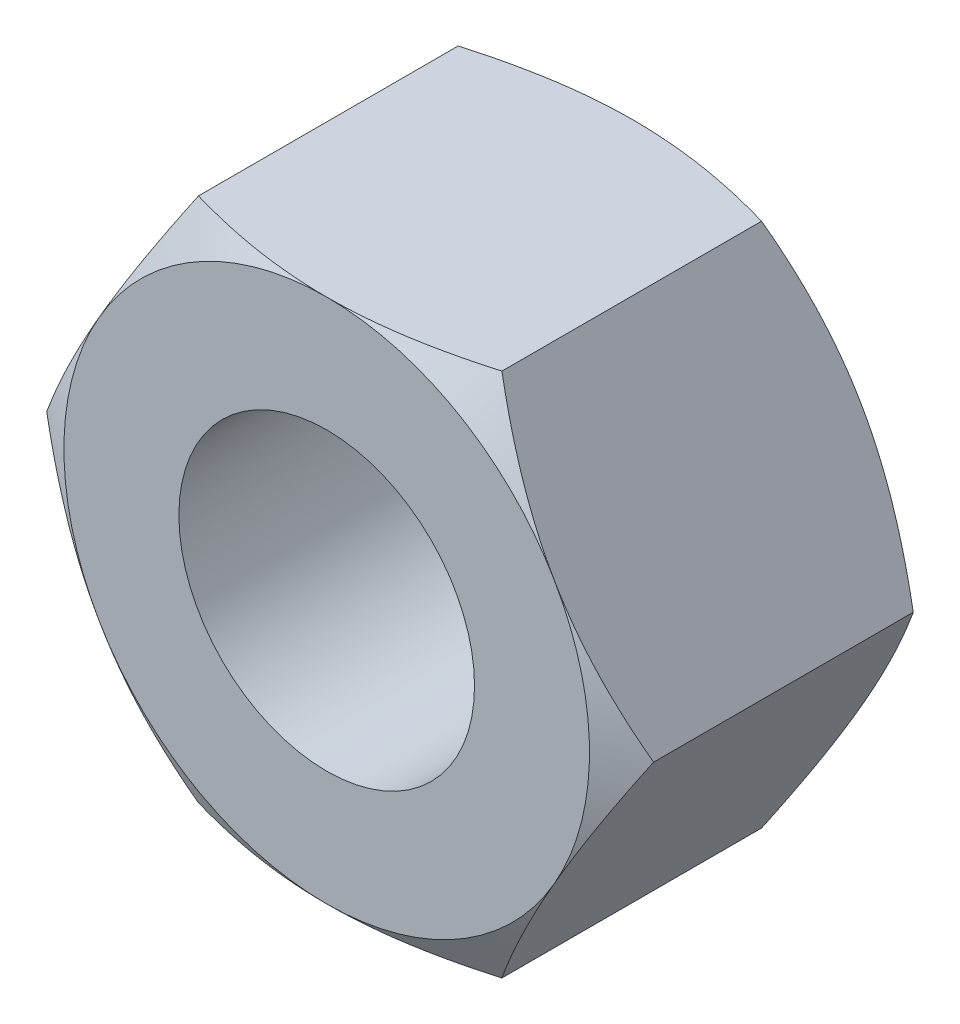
ISO-10303-21;
HEADER;
FILE_DESCRIPTION(('STEP AP214'),'2;1');
FILE_NAME('part.step','',(''),(''),'','','');
FILE_SCHEMA(('AUTOMOTIVE_DESIGN { 1 0 10303 214 1 1 1 1 }'));
ENDSEC;
DATA;
#1=APPLICATION_CONTEXT('core data for automotive mechanical design processes');
#2=APPLICATION_PROTOCOL_DEFINITION('international standard','automotive_design',2000,#1);
#3=PRODUCT_CONTEXT('',#1,'mechanical');
#4=PRODUCT('Part','Part','',(#3));
#5=PRODUCT_RELATED_PRODUCT_CATEGORY('part','',(#4));
#6=PRODUCT_DEFINITION_FORMATION('','',#4);
#7=PRODUCT_DEFINITION_CONTEXT('part definition',#1,'design');
#8=PRODUCT_DEFINITION('design','',#6,#7);
#9=PRODUCT_DEFINITION_SHAPE('','',#8);
#10=(LENGTH_UNIT() NAMED_UNIT(*) SI_UNIT(.MILLI.,.METRE.));
#11=(NAMED_UNIT(*) PLANE_ANGLE_UNIT() SI_UNIT($,.RADIAN.));
#12=(NAMED_UNIT(*) SI_UNIT($,.STERADIAN.) SOLID_ANGLE_UNIT());
#13=UNCERTAINTY_MEASURE_WITH_UNIT(LENGTH_MEASURE(1.E-05),#10,'distance_accuracy_value','');
#14=(GEOMETRIC_REPRESENTATION_CONTEXT(3) GLOBAL_UNCERTAINTY_ASSIGNED_CONTEXT((#13)) GLOBAL_UNIT_ASSIGNED_CONTEXT((#10,
#11,#12)) REPRESENTATION_CONTEXT('',''));
#15=CARTESIAN_POINT('',(0.,0.,0.));
#16=DIRECTION('',(0.,0.,1.));
#17=DIRECTION('',(1.,0.,0.));
#18=AXIS2_PLACEMENT_3D('',#15,#16,#17);
#19=CARTESIAN_POINT('',(-10.9985226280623,0.,11.1125));
#20=DIRECTION('',(0.866025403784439,0.499999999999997,0.));
#21=DIRECTION('',(-0.499999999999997,0.866025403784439,0.));
#22=AXIS2_PLACEMENT_3D('',#19,#20,#21);
#23=PLANE('',#22);
#24=CARTESIAN_POINT('',(-5.49914584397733,-9.52519999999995,0.850805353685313));
#25=CARTESIAN_POINT('',(-5.6200316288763,-9.31581967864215,0.781023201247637));
#26=CARTESIAN_POINT('',(-5.74136813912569,-9.10565867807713,0.714408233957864));
#27=CARTESIAN_POINT('',(-5.9850141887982,-8.68365134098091,0.588391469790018));
#28=CARTESIAN_POINT('',(-6.10732403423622,-8.47180447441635,0.528992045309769));
#29=CARTESIAN_POINT('',(-6.47622435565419,-7.83285037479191,0.362766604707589));
#30=CARTESIAN_POINT('',(-6.72427111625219,-7.40322078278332,0.26821832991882));
#31=CARTESIAN_POINT('',(-7.09546173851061,-6.76029976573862,0.157351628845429));
#32=CARTESIAN_POINT('',(-7.21749664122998,-6.54892911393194,0.125769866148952));
#33=CARTESIAN_POINT('',(-7.46213146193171,-6.12520917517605,0.0728092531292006));
#34=CARTESIAN_POINT('',(-7.58473139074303,-5.9128598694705,0.0514305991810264));
#35=CARTESIAN_POINT('',(-7.83013575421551,-5.48780704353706,0.0194239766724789));
#36=CARTESIAN_POINT('',(-7.95293977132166,-5.27510424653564,0.0087832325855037));
#37=CARTESIAN_POINT('',(-8.19866123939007,-4.84950217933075,-0.00152146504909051));
#38=CARTESIAN_POINT('',(-8.32157868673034,-4.63660291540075,-0.00118575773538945));
#39=CARTESIAN_POINT('',(-8.55137586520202,-4.23858252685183,0.00969884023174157));
#40=CARTESIAN_POINT('',(-8.65827181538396,-4.05343331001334,0.0189199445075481));
#41=CARTESIAN_POINT('',(-8.87181370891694,-3.68356790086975,0.0454848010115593));
#42=CARTESIAN_POINT('',(-8.97845963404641,-3.49885174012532,0.0628291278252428));
#43=CARTESIAN_POINT('',(-9.29798418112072,-2.94541899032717,0.126636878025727));
#44=CARTESIAN_POINT('',(-9.51029722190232,-2.57768201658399,0.184867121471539));
#45=CARTESIAN_POINT('',(-9.93717543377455,-1.83830726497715,0.330443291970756));
#46=CARTESIAN_POINT('',(-10.1516861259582,-1.46676384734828,0.41840629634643));
#47=CARTESIAN_POINT('',(-10.577508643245,-0.729217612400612,0.618045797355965));
#48=CARTESIAN_POINT('',(-10.7888259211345,-0.363205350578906,0.729675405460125));
#49=CARTESIAN_POINT('',(-10.9986380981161,0.000199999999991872,0.850805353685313));
#50=B_SPLINE_CURVE_WITH_KNOTS('',3,(#24,#25,#26,#27,#28,#29,#30,#31,#32,#33,#34,#35,#36,#37,#38,
#39,#40,#41,#42,#43,#44,#45,#46,#47,#48,#49),.UNSPECIFIED.,.F.,.F.,(4,2,2,2,2,2,2,2,2,2,2,2,4),
(0.,0.754861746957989,1.50997101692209,3.02340406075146,3.76154608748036,4.499702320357,
5.23697928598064,5.97423347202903,6.61604550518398,7.25790294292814,8.54252993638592,
9.85564695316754,11.1661863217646),.UNSPECIFIED.);
#51=CARTESIAN_POINT('',(-5.49926131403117,-9.525,0.850738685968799));
#52=VERTEX_POINT('',#51);
#53=CARTESIAN_POINT('',(-8.24889197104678,-4.76250000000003,0.));
#54=VERTEX_POINT('',#53);
#55=EDGE_CURVE('E243',#52,#54,#50,.T.);
#56=ORIENTED_EDGE('',*,*,#55,.F.);
#57=DIRECTION('',(0.,0.,-0.999999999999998));
#58=VECTOR('',#57,1.);
#59=CARTESIAN_POINT('',(-5.49926131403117,-9.525,11.1125));
#60=LINE('',#59,#58);
#61=CARTESIAN_POINT('',(-5.49926131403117,-9.525,10.2617613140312));
#62=VERTEX_POINT('',#61);
#63=EDGE_CURVE('E298',#62,#52,#60,.T.);
#64=ORIENTED_EDGE('',*,*,#63,.F.);
#65=CARTESIAN_POINT('',(-10.9986380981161,0.000199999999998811,10.2616946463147));
#66=CARTESIAN_POINT('',(-10.8777523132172,-0.209180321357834,10.3314767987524));
#67=CARTESIAN_POINT('',(-10.7564158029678,-0.419341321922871,10.3980917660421));
#68=CARTESIAN_POINT('',(-10.5127697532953,-0.841348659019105,10.52410853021));
#69=CARTESIAN_POINT('',(-10.3904599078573,-1.05319552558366,10.5835079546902));
#70=CARTESIAN_POINT('',(-10.0215595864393,-1.6921496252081,10.7497333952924));
#71=CARTESIAN_POINT('',(-9.77351282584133,-2.1217792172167,10.8442816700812));
#72=CARTESIAN_POINT('',(-9.40232220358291,-2.7647002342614,10.9551483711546));
#73=CARTESIAN_POINT('',(-9.28028730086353,-2.97607088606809,10.986730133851));
#74=CARTESIAN_POINT('',(-9.0356524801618,-3.39979082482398,11.0396907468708));
#75=CARTESIAN_POINT('',(-8.91305255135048,-3.61214013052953,11.061069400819));
#76=CARTESIAN_POINT('',(-8.667648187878,-4.03719295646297,11.0930760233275));
#77=CARTESIAN_POINT('',(-8.54484417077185,-4.2498957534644,11.1037167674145));
#78=CARTESIAN_POINT('',(-8.29912270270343,-4.67549782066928,11.1140214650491));
#79=CARTESIAN_POINT('',(-8.17620525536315,-4.88839708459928,11.1136857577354));
#80=CARTESIAN_POINT('',(-7.94640807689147,-5.28641747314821,11.1028011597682));
#81=CARTESIAN_POINT('',(-7.83951212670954,-5.47156668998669,11.0935800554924));
#82=CARTESIAN_POINT('',(-7.62597023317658,-5.84143209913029,11.0670151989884));
#83=CARTESIAN_POINT('',(-7.5193243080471,-6.02614825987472,11.0496708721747));
#84=CARTESIAN_POINT('',(-7.19979976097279,-6.57958100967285,10.9858631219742));
#85=CARTESIAN_POINT('',(-6.98748672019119,-6.94731798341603,10.9276328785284));
#86=CARTESIAN_POINT('',(-6.56060850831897,-7.68669273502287,10.7820567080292));
#87=CARTESIAN_POINT('',(-6.34609781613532,-8.05823615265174,10.6940937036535));
#88=CARTESIAN_POINT('',(-5.92027529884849,-8.79578238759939,10.494454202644));
#89=CARTESIAN_POINT('',(-5.70895802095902,-9.16179464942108,10.3828245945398));
#90=CARTESIAN_POINT('',(-5.49914584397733,-9.52519999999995,10.2616946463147));
#91=B_SPLINE_CURVE_WITH_KNOTS('',3,(#65,#66,#67,#68,#69,#70,#71,#72,#73,#74,#75,#76,#77,#78,#79,
#80,#81,#82,#83,#84,#85,#86,#87,#88,#89,#90),.UNSPECIFIED.,.F.,.F.,(4,2,2,2,2,2,2,2,2,2,2,2,4),
(0.,0.754861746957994,1.5099710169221,3.02340406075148,3.76154608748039,4.49970232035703,
5.23697928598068,5.97423347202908,6.61604550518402,7.25790294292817,8.54252993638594,
9.85564695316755,11.1661863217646),.UNSPECIFIED.);
#92=CARTESIAN_POINT('',(-8.24889197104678,-4.76250000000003,11.1125));
#93=VERTEX_POINT('',#92);
#94=EDGE_CURVE('E166',#93,#62,#91,.T.);
#95=ORIENTED_EDGE('',*,*,#94,.F.);
#96=CARTESIAN_POINT('',(-10.9985226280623,0.,10.2617613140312));
#97=VERTEX_POINT('',#96);
#98=EDGE_CURVE('E139',#97,#93,#91,.T.);
#99=ORIENTED_EDGE('',*,*,#98,.F.);
#100=DIRECTION('',(0.,0.,-0.999999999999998));
#101=VECTOR('',#100,1.);
#102=CARTESIAN_POINT('',(-10.9985226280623,0.,11.1125));
#103=LINE('',#102,#101);
#104=CARTESIAN_POINT('',(-10.9985226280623,0.,0.850738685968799));
#105=VERTEX_POINT('',#104);
#106=EDGE_CURVE('E273',#97,#105,#103,.T.);
#107=ORIENTED_EDGE('',*,*,#106,.T.);
#108=EDGE_CURVE('E231',#54,#105,#50,.T.);
#109=ORIENTED_EDGE('',*,*,#108,.F.);
#110=EDGE_LOOP('',(#56,#64,#95,#99,#107,#109));
#111=FACE_BOUND('',#110,.T.);
#112=ADVANCED_FACE('F36',(#111),#23,.F.);
#113=CARTESIAN_POINT('',(-5.49926131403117,-9.525,11.1125));
#114=DIRECTION('',(0.,0.999999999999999,0.));
#115=DIRECTION('',(-0.999999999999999,0.,0.));
#116=AXIS2_PLACEMENT_3D('',#113,#114,#115);
#117=PLANE('',#116);
#118=CARTESIAN_POINT('',(-14.8538841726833,-9.525,4.68837007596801));
#119=CARTESIAN_POINT('',(-14.6454646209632,-9.525,4.58707799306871));
#120=CARTESIAN_POINT('',(-14.4368026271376,-9.525,4.4862849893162));
#121=CARTESIAN_POINT('',(-14.018943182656,-9.525,4.28581005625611));
#122=CARTESIAN_POINT('',(-13.8097457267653,-9.525,4.18612813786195));
#123=CARTESIAN_POINT('',(-13.1812196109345,-9.525,3.88889258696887));
#124=CARTESIAN_POINT('',(-12.76101770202,-9.525,3.69317864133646));
#125=CARTESIAN_POINT('',(-11.9155818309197,-9.525,3.30678998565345));
#126=CARTESIAN_POINT('',(-11.4903329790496,-9.525,3.11614777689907));
#127=CARTESIAN_POINT('',(-10.6364807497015,-9.525,2.74255737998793));
#128=CARTESIAN_POINT('',(-10.2078775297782,-9.525,2.55960883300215));
#129=CARTESIAN_POINT('',(-9.33277340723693,-9.525,2.19770810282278));
#130=CARTESIAN_POINT('',(-8.88614031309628,-9.525,2.01907383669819));
#131=CARTESIAN_POINT('',(-7.9876813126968,-9.525,1.67512686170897));
#132=CARTESIAN_POINT('',(-7.53585483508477,-9.525,1.50981563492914));
#133=CARTESIAN_POINT('',(-6.62710261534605,-9.525,1.19679293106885));
#134=CARTESIAN_POINT('',(-6.17018900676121,-9.525,1.04904660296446));
#135=CARTESIAN_POINT('',(-5.24982594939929,-9.525,0.775836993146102));
#136=CARTESIAN_POINT('',(-4.78637858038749,-9.525,0.650366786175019));
#137=CARTESIAN_POINT('',(-3.85505029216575,-9.525,0.42831753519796));
#138=CARTESIAN_POINT('',(-3.38720636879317,-9.525,0.331587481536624));
#139=CARTESIAN_POINT('',(-2.68111682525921,-9.525,0.21222627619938));
#140=CARTESIAN_POINT('',(-2.44501721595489,-9.525,0.176726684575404));
#141=CARTESIAN_POINT('',(-1.9716167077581,-9.525,0.114999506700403));
#142=CARTESIAN_POINT('',(-1.73431592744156,-9.525,0.0887710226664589));
#143=CARTESIAN_POINT('',(-1.26196749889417,-9.525,0.0464419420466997));
#144=CARTESIAN_POINT('',(-1.02693147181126,-9.525,0.0302121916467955));
#145=CARTESIAN_POINT('',(-0.556383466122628,-9.525,0.00771065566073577));
#146=CARTESIAN_POINT('',(-0.320871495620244,-9.525,0.00143870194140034));
#147=CARTESIAN_POINT('',(0.150211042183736,-9.525,-0.000997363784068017));
#148=CARTESIAN_POINT('',(0.385781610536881,-9.525,0.00283872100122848));
#149=CARTESIAN_POINT('',(0.856549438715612,-9.525,0.0205242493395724));
#150=CARTESIAN_POINT('',(1.09174667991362,-9.525,0.0343741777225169));
#151=CARTESIAN_POINT('',(1.65429162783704,-9.525,0.0791810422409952));
#152=CARTESIAN_POINT('',(1.98128085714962,-9.525,0.114738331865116));
#153=CARTESIAN_POINT('',(2.63287267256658,-9.52499999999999,0.203289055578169));
#154=CARTESIAN_POINT('',(2.95747494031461,-9.525,0.256284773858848));
#155=CARTESIAN_POINT('',(3.92728538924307,-9.525,0.438621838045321));
#156=CARTESIAN_POINT('',(4.56816927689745,-9.525,0.591283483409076));
#157=CARTESIAN_POINT('',(5.52703389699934,-9.525,0.856639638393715));
#158=CARTESIAN_POINT('',(5.84996414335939,-9.525,0.952481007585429));
#159=CARTESIAN_POINT('',(6.49268727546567,-9.525,1.15425668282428));
#160=CARTESIAN_POINT('',(6.81248013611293,-9.525,1.2601910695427));
#161=CARTESIAN_POINT('',(7.44903337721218,-9.525,1.48044284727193));
#162=CARTESIAN_POINT('',(7.76579462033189,-9.525,1.59475776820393));
#163=CARTESIAN_POINT('',(8.39667963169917,-9.52499999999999,1.83040468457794));
#164=CARTESIAN_POINT('',(8.71080347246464,-9.52499999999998,1.95173648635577));
#165=CARTESIAN_POINT('',(9.31484759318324,-9.52499999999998,2.19158515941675));
#166=CARTESIAN_POINT('',(9.6049255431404,-9.52499999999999,2.30970643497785));
#167=CARTESIAN_POINT('',(10.1832874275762,-9.525,2.55026889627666));
#168=CARTESIAN_POINT('',(10.4715713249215,-9.525,2.67271017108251));
#169=CARTESIAN_POINT('',(11.334101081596,-9.52499999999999,3.04555547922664));
#170=CARTESIAN_POINT('',(11.9059703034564,-9.52499999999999,3.30145898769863));
#171=CARTESIAN_POINT('',(13.0449836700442,-9.52499999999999,3.82415150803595));
#172=CARTESIAN_POINT('',(13.6121256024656,-9.52499999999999,4.09094530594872));
#173=CARTESIAN_POINT('',(14.7424752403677,-9.52499999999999,4.63265068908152));
#174=CARTESIAN_POINT('',(15.3056831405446,-9.52499999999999,4.90756186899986));
#175=CARTESIAN_POINT('',(16.4299927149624,-9.52499999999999,5.46410987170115));
#176=CARTESIAN_POINT('',(16.9910889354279,-9.52499999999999,5.74575768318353));
#177=CARTESIAN_POINT('',(18.1108024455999,-9.52499999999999,6.31394510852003));
#178=CARTESIAN_POINT('',(18.669419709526,-9.52499999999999,6.60048477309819));
#179=CARTESIAN_POINT('',(19.7845037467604,-9.52499999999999,7.1773706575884));
#180=CARTESIAN_POINT('',(20.3409710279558,-9.52499999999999,7.467715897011));
#181=CARTESIAN_POINT('',(21.452258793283,-9.52499999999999,8.05153261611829));
#182=CARTESIAN_POINT('',(22.0070792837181,-9.52499999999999,8.3450040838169));
#183=CARTESIAN_POINT('',(23.5416173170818,-9.52499999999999,9.16119940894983));
#184=CARTESIAN_POINT('',(24.5198965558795,-9.52499999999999,9.68662673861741));
#185=CARTESIAN_POINT('',(26.4734466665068,-9.52499999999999,10.7432006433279));
#186=CARTESIAN_POINT('',(27.4487173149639,-9.52499999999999,11.2743476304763));
#187=CARTESIAN_POINT('',(29.3935091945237,-9.52499999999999,12.3389832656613));
#188=CARTESIAN_POINT('',(30.3630385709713,-9.52499999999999,12.87245704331));
#189=CARTESIAN_POINT('',(31.8159654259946,-9.52499999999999,13.675040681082));
#190=CARTESIAN_POINT('',(32.3000255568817,-9.52499999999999,13.9429523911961));
#191=CARTESIAN_POINT('',(33.2677525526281,-9.52499999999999,14.4794839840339));
#192=CARTESIAN_POINT('',(33.7514194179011,-9.52499999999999,14.7481038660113));
#193=CARTESIAN_POINT('',(34.2349143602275,-9.52499999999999,15.0170329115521));
#194=B_SPLINE_CURVE_WITH_KNOTS('',3,(#118,#119,#120,#121,#122,#123,#124,#125,#126,#127,#128,
#129,#130,#131,#132,#133,#134,#135,#136,#137,#138,#139,#140,#141,#142,#143,#144,#145,#146,#147,
#148,#149,#150,#151,#152,#153,#154,#155,#156,#157,#158,#159,#160,#161,#162,#163,#164,#165,#166,
#167,#168,#169,#170,#171,#172,#173,#174,#175,#176,#177,#178,#179,#180,#181,#182,#183,#184,#185,
#186,#187,#188,#189,#190,#191,#192,#193),.UNSPECIFIED.,.F.,.F.,(4,2,2,2,2,2,2,2,2,2,2,2,2,2,2,2,
2,2,2,2,2,2,2,2,2,2,2,2,2,2,2,2,2,2,2,2,2,4),(0.,0.695188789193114,1.3903844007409,
2.78097751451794,4.17899851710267,5.5769542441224,7.01988388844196,8.46297382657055,
9.90315093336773,11.3428795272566,12.7749038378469,13.4910110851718,14.2070489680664,
14.9136324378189,15.6202039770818,16.3267892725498,17.0334087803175,18.019604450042,
19.0059293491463,20.9795625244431,21.9900328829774,23.0005113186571,24.0106931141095,
25.0208470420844,25.9604247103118,26.9000217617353,28.779392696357,30.6595986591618,
32.5397109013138,34.4231331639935,36.3065749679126,38.1895406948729,40.072499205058,
43.4038260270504,46.7353945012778,50.0552103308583,51.7149743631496,53.3747366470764),.UNSPECIFIED.);
#195=CARTESIAN_POINT('',(5.49926131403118,-9.525,0.850738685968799));
#196=VERTEX_POINT('',#195);
#197=CARTESIAN_POINT('',(0.,-9.525,0.));
#198=VERTEX_POINT('',#197);
#199=EDGE_CURVE('E158',#196,#198,#194,.F.);
#200=ORIENTED_EDGE('',*,*,#199,.F.);
#201=DIRECTION('',(0.,0.,-0.999999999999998));
#202=VECTOR('',#201,1.);
#203=CARTESIAN_POINT('',(5.49926131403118,-9.525,11.1125));
#204=LINE('',#203,#202);
#205=CARTESIAN_POINT('',(5.49926131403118,-9.525,10.2617613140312));
#206=VERTEX_POINT('',#205);
#207=EDGE_CURVE('E295',#206,#196,#204,.T.);
#208=ORIENTED_EDGE('',*,*,#207,.F.);
#209=CARTESIAN_POINT('',(-14.8538841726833,-9.525,6.42412992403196));
#210=CARTESIAN_POINT('',(-14.6454646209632,-9.525,6.52542200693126));
#211=CARTESIAN_POINT('',(-14.4368026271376,-9.525,6.62621501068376));
#212=CARTESIAN_POINT('',(-14.018943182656,-9.525,6.82668994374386));
#213=CARTESIAN_POINT('',(-13.8097457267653,-9.525,6.92637186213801));
#214=CARTESIAN_POINT('',(-13.1812196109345,-9.525,7.2236074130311));
#215=CARTESIAN_POINT('',(-12.76101770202,-9.525,7.41932135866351));
#216=CARTESIAN_POINT('',(-11.9155818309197,-9.525,7.80571001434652));
#217=CARTESIAN_POINT('',(-11.4903329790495,-9.525,7.9963522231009));
#218=CARTESIAN_POINT('',(-10.6364807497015,-9.525,8.36994262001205));
#219=CARTESIAN_POINT('',(-10.2078775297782,-9.525,8.55289116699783));
#220=CARTESIAN_POINT('',(-9.33277340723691,-9.525,8.91479189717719));
#221=CARTESIAN_POINT('',(-8.88614031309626,-9.525,9.09342616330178));
#222=CARTESIAN_POINT('',(-7.98768131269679,-9.525,9.437373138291));
#223=CARTESIAN_POINT('',(-7.53585483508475,-9.525,9.60268436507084));
#224=CARTESIAN_POINT('',(-6.62710261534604,-9.525,9.91570706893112));
#225=CARTESIAN_POINT('',(-6.17018900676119,-9.525,10.0634533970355));
#226=CARTESIAN_POINT('',(-5.24982594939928,-9.525,10.3366630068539));
#227=CARTESIAN_POINT('',(-4.78637858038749,-9.525,10.462133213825));
#228=CARTESIAN_POINT('',(-3.85505029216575,-9.525,10.6841824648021));
#229=CARTESIAN_POINT('',(-3.38720636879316,-9.525,10.7809125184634));
#230=CARTESIAN_POINT('',(-2.6811168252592,-9.525,10.9002737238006));
#231=CARTESIAN_POINT('',(-2.44501721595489,-9.525,10.9357733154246));
#232=CARTESIAN_POINT('',(-1.97161670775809,-9.525,10.9975004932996));
#233=CARTESIAN_POINT('',(-1.73431592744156,-9.525,11.0237289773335));
#234=CARTESIAN_POINT('',(-1.26196749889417,-9.525,11.0660580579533));
#235=CARTESIAN_POINT('',(-1.02693147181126,-9.525,11.0822878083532));
#236=CARTESIAN_POINT('',(-0.556383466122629,-9.525,11.1047893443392));
#237=CARTESIAN_POINT('',(-0.320871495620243,-9.525,11.1110612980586));
#238=CARTESIAN_POINT('',(0.150211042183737,-9.525,11.113497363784));
#239=CARTESIAN_POINT('',(0.385781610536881,-9.525,11.1096612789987));
#240=CARTESIAN_POINT('',(0.856549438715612,-9.525,11.0919757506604));
#241=CARTESIAN_POINT('',(1.09174667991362,-9.525,11.0781258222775));
#242=CARTESIAN_POINT('',(1.65429162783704,-9.525,11.033318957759));
#243=CARTESIAN_POINT('',(1.98128085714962,-9.525,10.9977616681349));
#244=CARTESIAN_POINT('',(2.63287267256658,-9.52499999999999,10.9092109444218));
#245=CARTESIAN_POINT('',(2.95747494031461,-9.525,10.8562152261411));
#246=CARTESIAN_POINT('',(3.92728538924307,-9.525,10.6738781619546));
#247=CARTESIAN_POINT('',(4.56816927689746,-9.525,10.5212165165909));
#248=CARTESIAN_POINT('',(5.52703389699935,-9.525,10.2558603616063));
#249=CARTESIAN_POINT('',(5.84996414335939,-9.525,10.1600189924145));
#250=CARTESIAN_POINT('',(6.49268727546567,-9.525,9.95824331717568));
#251=CARTESIAN_POINT('',(6.81248013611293,-9.525,9.85230893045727));
#252=CARTESIAN_POINT('',(7.44903337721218,-9.525,9.63205715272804));
#253=CARTESIAN_POINT('',(7.76579462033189,-9.525,9.51774223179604));
#254=CARTESIAN_POINT('',(8.39667963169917,-9.52499999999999,9.28209531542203));
#255=CARTESIAN_POINT('',(8.71080347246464,-9.52499999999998,9.1607635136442));
#256=CARTESIAN_POINT('',(9.31484759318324,-9.52499999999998,8.92091484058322));
#257=CARTESIAN_POINT('',(9.60492554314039,-9.52499999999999,8.80279356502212));
#258=CARTESIAN_POINT('',(10.1832874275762,-9.525,8.56223110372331));
#259=CARTESIAN_POINT('',(10.4715713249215,-9.525,8.43978982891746));
#260=CARTESIAN_POINT('',(11.334101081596,-9.52499999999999,8.06694452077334));
#261=CARTESIAN_POINT('',(11.9059703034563,-9.52499999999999,7.81104101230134));
#262=CARTESIAN_POINT('',(13.0449836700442,-9.52499999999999,7.28834849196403));
#263=CARTESIAN_POINT('',(13.6121256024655,-9.52499999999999,7.02155469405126));
#264=CARTESIAN_POINT('',(14.7424752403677,-9.52499999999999,6.47984931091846));
#265=CARTESIAN_POINT('',(15.3056831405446,-9.52499999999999,6.20493813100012));
#266=CARTESIAN_POINT('',(16.4299927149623,-9.52499999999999,5.64839012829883));
#267=CARTESIAN_POINT('',(16.9910889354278,-9.52499999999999,5.36674231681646));
#268=CARTESIAN_POINT('',(18.1108024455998,-9.52499999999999,4.79855489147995));
#269=CARTESIAN_POINT('',(18.669419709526,-9.52499999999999,4.5120152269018));
#270=CARTESIAN_POINT('',(19.7845037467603,-9.52499999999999,3.93512934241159));
#271=CARTESIAN_POINT('',(20.3409710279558,-9.52499999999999,3.644784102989));
#272=CARTESIAN_POINT('',(21.4522587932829,-9.52499999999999,3.0609673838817));
#273=CARTESIAN_POINT('',(22.0070792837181,-9.52499999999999,2.76749591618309));
#274=CARTESIAN_POINT('',(23.5416173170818,-9.52499999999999,1.95130059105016));
#275=CARTESIAN_POINT('',(24.5198965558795,-9.52499999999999,1.42587326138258));
#276=CARTESIAN_POINT('',(26.4734466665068,-9.52499999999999,0.369299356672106));
#277=CARTESIAN_POINT('',(27.4487173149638,-9.52499999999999,-0.161847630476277));
#278=CARTESIAN_POINT('',(29.3935091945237,-9.52499999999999,-1.22648326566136));
#279=CARTESIAN_POINT('',(30.3630385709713,-9.52499999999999,-1.75995704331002));
#280=CARTESIAN_POINT('',(31.8159654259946,-9.52499999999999,-2.56254068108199));
#281=CARTESIAN_POINT('',(32.3000255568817,-9.52499999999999,-2.83045239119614));
#282=CARTESIAN_POINT('',(33.2677525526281,-9.52499999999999,-3.36698398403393));
#283=CARTESIAN_POINT('',(33.7514194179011,-9.52499999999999,-3.63560386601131));
#284=CARTESIAN_POINT('',(34.2349143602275,-9.52499999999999,-3.90453291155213));
#285=B_SPLINE_CURVE_WITH_KNOTS('',3,(#209,#210,#211,#212,#213,#214,#215,#216,#217,#218,#219,
#220,#221,#222,#223,#224,#225,#226,#227,#228,#229,#230,#231,#232,#233,#234,#235,#236,#237,#238,
#239,#240,#241,#242,#243,#244,#245,#246,#247,#248,#249,#250,#251,#252,#253,#254,#255,#256,#257,
#258,#259,#260,#261,#262,#263,#264,#265,#266,#267,#268,#269,#270,#271,#272,#273,#274,#275,#276,
#277,#278,#279,#280,#281,#282,#283,#284),.UNSPECIFIED.,.F.,.F.,(4,2,2,2,2,2,2,2,2,2,2,2,2,2,2,2,
2,2,2,2,2,2,2,2,2,2,2,2,2,2,2,2,2,2,2,2,2,4),(0.,0.695188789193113,1.3903844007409,
2.78097751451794,4.17899851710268,5.57695424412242,7.01988388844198,8.46297382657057,
9.90315093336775,11.3428795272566,12.7749038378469,13.4910110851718,14.2070489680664,
14.9136324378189,15.6202039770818,16.3267892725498,17.0334087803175,18.019604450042,
19.0059293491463,20.9795625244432,21.9900328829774,23.0005113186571,24.0106931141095,
25.0208470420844,25.9604247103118,26.9000217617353,28.779392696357,30.6595986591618,
32.5397109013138,34.4231331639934,36.3065749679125,38.1895406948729,40.072499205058,
43.4038260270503,46.7353945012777,50.0552103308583,51.7149743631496,53.3747366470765),.UNSPECIFIED.);
#286=CARTESIAN_POINT('',(0.,-9.525,11.1125));
#287=VERTEX_POINT('',#286);
#288=EDGE_CURVE('E210',#287,#206,#285,.T.);
#289=ORIENTED_EDGE('',*,*,#288,.F.);
#290=EDGE_CURVE('E322',#62,#287,#285,.T.);
#291=ORIENTED_EDGE('',*,*,#290,.F.);
#292=ORIENTED_EDGE('',*,*,#63,.T.);
#293=EDGE_CURVE('E244',#198,#52,#194,.F.);
#294=ORIENTED_EDGE('',*,*,#293,.F.);
#295=EDGE_LOOP('',(#200,#208,#289,#291,#292,#294));
#296=FACE_BOUND('',#295,.T.);
#297=ADVANCED_FACE('F219',(#296),#117,.F.);
#298=CARTESIAN_POINT('',(5.49926131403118,-9.525,11.1125));
#299=DIRECTION('',(-0.866025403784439,0.499999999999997,0.));
#300=DIRECTION('',(-0.499999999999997,-0.866025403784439,0.));
#301=AXIS2_PLACEMENT_3D('',#298,#299,#300);
#302=PLANE('',#301);
#303=CARTESIAN_POINT('',(10.9986380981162,0.000199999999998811,0.850805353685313));
#304=CARTESIAN_POINT('',(10.8777523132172,-0.209180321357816,0.781023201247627));
#305=CARTESIAN_POINT('',(10.7564158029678,-0.419341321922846,0.714408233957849));
#306=CARTESIAN_POINT('',(10.5127697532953,-0.841348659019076,0.588391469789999));
#307=CARTESIAN_POINT('',(10.3904599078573,-1.05319552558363,0.52899204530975));
#308=CARTESIAN_POINT('',(10.0215595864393,-1.69214962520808,0.362766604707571));
#309=CARTESIAN_POINT('',(9.77351282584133,-2.12177921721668,0.268218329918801));
#310=CARTESIAN_POINT('',(9.4023222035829,-2.76470023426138,0.157351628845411));
#311=CARTESIAN_POINT('',(9.28028730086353,-2.97607088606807,0.125769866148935));
#312=CARTESIAN_POINT('',(9.0356524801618,-3.39979082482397,0.0728092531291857));
#313=CARTESIAN_POINT('',(8.91305255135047,-3.61214013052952,0.051430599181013));
#314=CARTESIAN_POINT('',(8.66764818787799,-4.03719295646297,0.0194239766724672));
#315=CARTESIAN_POINT('',(8.54484417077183,-4.24989575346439,0.00878323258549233));
#316=CARTESIAN_POINT('',(8.29912270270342,-4.67549782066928,-0.00152146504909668));
#317=CARTESIAN_POINT('',(8.17620525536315,-4.88839708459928,-0.00118575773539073));
#318=CARTESIAN_POINT('',(7.94640807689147,-5.28641747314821,0.00969884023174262));
#319=CARTESIAN_POINT('',(7.83951212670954,-5.47156668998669,0.0189199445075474));
#320=CARTESIAN_POINT('',(7.62597023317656,-5.84143209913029,0.0454848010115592));
#321=CARTESIAN_POINT('',(7.51932430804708,-6.02614825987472,0.062829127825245));
#322=CARTESIAN_POINT('',(7.19979976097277,-6.57958100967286,0.126636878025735));
#323=CARTESIAN_POINT('',(6.98748672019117,-6.94731798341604,0.184867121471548));
#324=CARTESIAN_POINT('',(6.56060850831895,-7.68669273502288,0.330443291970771));
#325=CARTESIAN_POINT('',(6.34609781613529,-8.05823615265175,0.418406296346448));
#326=CARTESIAN_POINT('',(5.92027529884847,-8.79578238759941,0.618045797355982));
#327=CARTESIAN_POINT('',(5.708958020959,-9.16179464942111,0.729675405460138));
#328=CARTESIAN_POINT('',(5.49914584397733,-9.5252,0.850805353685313));
#329=B_SPLINE_CURVE_WITH_KNOTS('',3,(#303,#304,#305,#306,#307,#308,#309,#310,#311,#312,#313,
#314,#315,#316,#317,#318,#319,#320,#321,#322,#323,#324,#325,#326,#327,#328),.UNSPECIFIED.,.F.,
.F.,(4,2,2,2,2,2,2,2,2,2,2,2,4),(0.,0.754861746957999,1.50997101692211,3.0234040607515,
3.76154608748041,4.49970232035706,5.23697928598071,5.97423347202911,6.61604550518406,
7.25790294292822,8.54252993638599,9.85564695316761,11.1661863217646),.UNSPECIFIED.);
#330=CARTESIAN_POINT('',(10.9985226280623,0.,0.850738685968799));
#331=VERTEX_POINT('',#330);
#332=CARTESIAN_POINT('',(8.24889197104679,-4.76249999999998,0.));
#333=VERTEX_POINT('',#332);
#334=EDGE_CURVE('E225',#331,#333,#329,.T.);
#335=ORIENTED_EDGE('',*,*,#334,.F.);
#336=DIRECTION('',(0.,0.,-0.999999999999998));
#337=VECTOR('',#336,1.);
#338=CARTESIAN_POINT('',(10.9985226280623,0.,11.1125));
#339=LINE('',#338,#337);
#340=CARTESIAN_POINT('',(10.9985226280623,0.,10.2617613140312));
#341=VERTEX_POINT('',#340);
#342=EDGE_CURVE('E299',#341,#331,#339,.T.);
#343=ORIENTED_EDGE('',*,*,#342,.F.);
#344=CARTESIAN_POINT('',(5.49914584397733,-9.5252,10.2616946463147));
#345=CARTESIAN_POINT('',(5.62003162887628,-9.31581967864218,10.3314767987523));
#346=CARTESIAN_POINT('',(5.74136813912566,-9.10565867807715,10.3980917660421));
#347=CARTESIAN_POINT('',(5.98501418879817,-8.68365134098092,10.52410853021));
#348=CARTESIAN_POINT('',(6.10732403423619,-8.47180447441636,10.5835079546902));
#349=CARTESIAN_POINT('',(6.47622435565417,-7.83285037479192,10.7497333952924));
#350=CARTESIAN_POINT('',(6.72427111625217,-7.40322078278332,10.8442816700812));
#351=CARTESIAN_POINT('',(7.0954617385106,-6.76029976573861,10.9551483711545));
#352=CARTESIAN_POINT('',(7.21749664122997,-6.54892911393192,10.986730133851));
#353=CARTESIAN_POINT('',(7.4621314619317,-6.12520917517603,11.0396907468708));
#354=CARTESIAN_POINT('',(7.58473139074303,-5.91285986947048,11.061069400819));
#355=CARTESIAN_POINT('',(7.83013575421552,-5.48780704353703,11.0930760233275));
#356=CARTESIAN_POINT('',(7.95293977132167,-5.27510424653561,11.1037167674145));
#357=CARTESIAN_POINT('',(8.19866123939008,-4.84950217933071,11.1140214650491));
#358=CARTESIAN_POINT('',(8.32157868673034,-4.6366029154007,11.1136857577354));
#359=CARTESIAN_POINT('',(8.55137586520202,-4.23858252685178,11.1028011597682));
#360=CARTESIAN_POINT('',(8.65827181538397,-4.0534333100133,11.0935800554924));
#361=CARTESIAN_POINT('',(8.87181370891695,-3.68356790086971,11.0670151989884));
#362=CARTESIAN_POINT('',(8.97845963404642,-3.49885174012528,11.0496708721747));
#363=CARTESIAN_POINT('',(9.29798418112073,-2.94541899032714,10.9858631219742));
#364=CARTESIAN_POINT('',(9.51029722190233,-2.57768201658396,10.9276328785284));
#365=CARTESIAN_POINT('',(9.93717543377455,-1.83830726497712,10.7820567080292));
#366=CARTESIAN_POINT('',(10.1516861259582,-1.46676384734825,10.6940937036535));
#367=CARTESIAN_POINT('',(10.577508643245,-0.729217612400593,10.494454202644));
#368=CARTESIAN_POINT('',(10.7888259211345,-0.363205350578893,10.3828245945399));
#369=CARTESIAN_POINT('',(10.9986380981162,0.000199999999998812,10.2616946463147));
#370=B_SPLINE_CURVE_WITH_KNOTS('',3,(#344,#345,#346,#347,#348,#349,#350,#351,#352,#353,#354,
#355,#356,#357,#358,#359,#360,#361,#362,#363,#364,#365,#366,#367,#368,#369),.UNSPECIFIED.,.F.,
.F.,(4,2,2,2,2,2,2,2,2,2,2,2,4),(0.,0.754861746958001,1.50997101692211,3.02340406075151,
3.76154608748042,4.49970232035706,5.23697928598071,5.97423347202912,6.61604550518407,
7.25790294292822,8.54252993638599,9.85564695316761,11.1661863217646),.UNSPECIFIED.);
#371=CARTESIAN_POINT('',(8.24889197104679,-4.76249999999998,11.1125));
#372=VERTEX_POINT('',#371);
#373=EDGE_CURVE('E203',#372,#341,#370,.T.);
#374=ORIENTED_EDGE('',*,*,#373,.F.);
#375=EDGE_CURVE('E208',#206,#372,#370,.T.);
#376=ORIENTED_EDGE('',*,*,#375,.F.);
#377=ORIENTED_EDGE('',*,*,#207,.T.);
#378=EDGE_CURVE('E233',#333,#196,#329,.T.);
#379=ORIENTED_EDGE('',*,*,#378,.F.);
#380=EDGE_LOOP('',(#335,#343,#374,#376,#377,#379));
#381=FACE_BOUND('',#380,.T.);
#382=ADVANCED_FACE('F215',(#381),#302,.F.);
#383=CARTESIAN_POINT('',(5.49926131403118,9.525,11.1125));
#384=DIRECTION('',(0.866025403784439,0.499999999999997,0.));
#385=DIRECTION('',(-0.499999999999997,0.866025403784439,0.));
#386=AXIS2_PLACEMENT_3D('',#383,#384,#385);
#387=PLANE('',#386);
#388=ORIENTED_EDGE('',*,*,#342,.T.);
#389=CARTESIAN_POINT('',(10.9986380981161,-0.000200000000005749,0.850805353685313));
#390=CARTESIAN_POINT('',(10.8777523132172,0.209180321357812,0.781023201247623));
#391=CARTESIAN_POINT('',(10.7564158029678,0.419341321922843,0.714408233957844));
#392=CARTESIAN_POINT('',(10.5127697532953,0.841348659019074,0.588391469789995));
#393=CARTESIAN_POINT('',(10.3904599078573,1.05319552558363,0.528992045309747));
#394=CARTESIAN_POINT('',(10.0215595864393,1.69214962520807,0.36276660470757));
#395=CARTESIAN_POINT('',(9.77351282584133,2.12177921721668,0.268218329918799));
#396=CARTESIAN_POINT('',(9.4023222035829,2.76470023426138,0.157351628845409));
#397=CARTESIAN_POINT('',(9.28028730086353,2.97607088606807,0.125769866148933));
#398=CARTESIAN_POINT('',(9.0356524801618,3.39979082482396,0.0728092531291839));
#399=CARTESIAN_POINT('',(8.91305255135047,3.61214013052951,0.0514305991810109));
#400=CARTESIAN_POINT('',(8.66764818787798,4.03719295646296,0.0194239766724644));
#401=CARTESIAN_POINT('',(8.54484417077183,4.24989575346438,0.00878323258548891));
#402=CARTESIAN_POINT('',(8.29912270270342,4.67549782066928,-0.00152146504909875));
#403=CARTESIAN_POINT('',(8.17620525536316,4.88839708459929,-0.00118575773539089));
#404=CARTESIAN_POINT('',(7.94640807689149,5.28641747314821,0.00969884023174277));
#405=CARTESIAN_POINT('',(7.83951212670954,5.47156668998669,0.0189199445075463));
#406=CARTESIAN_POINT('',(7.62597023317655,5.84143209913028,0.0454848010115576));
#407=CARTESIAN_POINT('',(7.51932430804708,6.02614825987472,0.062829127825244));
#408=CARTESIAN_POINT('',(7.19979976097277,6.57958100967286,0.126636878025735));
#409=CARTESIAN_POINT('',(6.98748672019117,6.94731798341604,0.184867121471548));
#410=CARTESIAN_POINT('',(6.56060850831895,7.68669273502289,0.330443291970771));
#411=CARTESIAN_POINT('',(6.34609781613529,8.05823615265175,0.418406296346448));
#412=CARTESIAN_POINT('',(5.92027529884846,8.79578238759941,0.618045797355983));
#413=CARTESIAN_POINT('',(5.708958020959,9.16179464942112,0.729675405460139));
#414=CARTESIAN_POINT('',(5.49914584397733,9.5252,0.850805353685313));
#415=B_SPLINE_CURVE_WITH_KNOTS('',3,(#389,#390,#391,#392,#393,#394,#395,#396,#397,#398,#399,
#400,#401,#402,#403,#404,#405,#406,#407,#408,#409,#410,#411,#412,#413,#414),.UNSPECIFIED.,.F.,
.F.,(4,2,2,2,2,2,2,2,2,2,2,2,4),(0.,0.754861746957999,1.50997101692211,3.0234040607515,
3.76154608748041,4.49970232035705,5.2369792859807,5.97423347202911,6.61604550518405,
7.25790294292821,8.54252993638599,9.85564695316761,11.1661863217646),.UNSPECIFIED.);
#416=CARTESIAN_POINT('',(8.24889197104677,4.76249999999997,0.));
#417=VERTEX_POINT('',#416);
#418=EDGE_CURVE('E232',#331,#417,#415,.T.);
#419=ORIENTED_EDGE('',*,*,#418,.T.);
#420=CARTESIAN_POINT('',(5.49926131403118,9.525,0.850738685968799));
#421=VERTEX_POINT('',#420);
#422=EDGE_CURVE('E234',#417,#421,#415,.T.);
#423=ORIENTED_EDGE('',*,*,#422,.T.);
#424=DIRECTION('',(0.,0.,-0.999999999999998));
#425=VECTOR('',#424,1.);
#426=CARTESIAN_POINT('',(5.49926131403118,9.525,11.1125));
#427=LINE('',#426,#425);
#428=CARTESIAN_POINT('',(5.49926131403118,9.525,10.2617613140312));
#429=VERTEX_POINT('',#428);
#430=EDGE_CURVE('E303',#429,#421,#427,.T.);
#431=ORIENTED_EDGE('',*,*,#430,.F.);
#432=CARTESIAN_POINT('',(5.49914584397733,9.5252,10.2616946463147));
#433=CARTESIAN_POINT('',(5.62003162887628,9.31581967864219,10.3314767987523));
#434=CARTESIAN_POINT('',(5.74136813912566,9.10565867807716,10.3980917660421));
#435=CARTESIAN_POINT('',(5.98501418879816,8.68365134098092,10.5241085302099));
#436=CARTESIAN_POINT('',(6.10732403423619,8.47180447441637,10.5835079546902));
#437=CARTESIAN_POINT('',(6.47622435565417,7.83285037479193,10.7497333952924));
#438=CARTESIAN_POINT('',(6.72427111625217,7.40322078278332,10.8442816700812));
#439=CARTESIAN_POINT('',(7.09546173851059,6.76029976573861,10.9551483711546));
#440=CARTESIAN_POINT('',(7.21749664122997,6.54892911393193,10.986730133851));
#441=CARTESIAN_POINT('',(7.4621314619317,6.12520917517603,11.0396907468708));
#442=CARTESIAN_POINT('',(7.58473139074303,5.91285986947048,11.061069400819));
#443=CARTESIAN_POINT('',(7.83013575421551,5.48780704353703,11.0930760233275));
#444=CARTESIAN_POINT('',(7.95293977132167,5.27510424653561,11.1037167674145));
#445=CARTESIAN_POINT('',(8.19866123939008,4.84950217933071,11.1140214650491));
#446=CARTESIAN_POINT('',(8.32157868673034,4.63660291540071,11.1136857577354));
#447=CARTESIAN_POINT('',(8.55137586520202,4.23858252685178,11.1028011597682));
#448=CARTESIAN_POINT('',(8.65827181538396,4.0534333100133,11.0935800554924));
#449=CARTESIAN_POINT('',(8.87181370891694,3.68356790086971,11.0670151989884));
#450=CARTESIAN_POINT('',(8.97845963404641,3.49885174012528,11.0496708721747));
#451=CARTESIAN_POINT('',(9.29798418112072,2.94541899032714,10.9858631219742));
#452=CARTESIAN_POINT('',(9.51029722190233,2.57768201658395,10.9276328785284));
#453=CARTESIAN_POINT('',(9.93717543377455,1.83830726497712,10.7820567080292));
#454=CARTESIAN_POINT('',(10.1516861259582,1.46676384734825,10.6940937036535));
#455=CARTESIAN_POINT('',(10.577508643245,0.729217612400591,10.494454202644));
#456=CARTESIAN_POINT('',(10.7888259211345,0.363205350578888,10.3828245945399));
#457=CARTESIAN_POINT('',(10.9986380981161,-0.000200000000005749,10.2616946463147));
#458=B_SPLINE_CURVE_WITH_KNOTS('',3,(#432,#433,#434,#435,#436,#437,#438,#439,#440,#441,#442,
#443,#444,#445,#446,#447,#448,#449,#450,#451,#452,#453,#454,#455,#456,#457),.UNSPECIFIED.,.F.,
.F.,(4,2,2,2,2,2,2,2,2,2,2,2,4),(0.,0.754861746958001,1.50997101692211,3.02340406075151,
3.76154608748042,4.49970232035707,5.23697928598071,5.97423347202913,6.61604550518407,
7.25790294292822,8.542529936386,9.85564695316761,11.1661863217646),.UNSPECIFIED.);
#459=CARTESIAN_POINT('',(8.24889197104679,4.76249999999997,11.1125));
#460=VERTEX_POINT('',#459);
#461=EDGE_CURVE('E134',#429,#460,#458,.T.);
#462=ORIENTED_EDGE('',*,*,#461,.T.);
#463=EDGE_CURVE('E209',#460,#341,#458,.T.);
#464=ORIENTED_EDGE('',*,*,#463,.T.);
#465=EDGE_LOOP('',(#388,#419,#423,#431,#462,#464));
#466=FACE_BOUND('',#465,.T.);
#467=ADVANCED_FACE('F218',(#466),#387,.T.);
#468=CARTESIAN_POINT('',(-5.49926131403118,9.52499999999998,11.1125));
#469=DIRECTION('',(0.,0.999999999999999,0.));
#470=DIRECTION('',(-0.999999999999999,0.,0.));
#471=AXIS2_PLACEMENT_3D('',#468,#469,#470);
#472=PLANE('',#471);
#473=ORIENTED_EDGE('',*,*,#430,.T.);
#474=CARTESIAN_POINT('',(-14.8538841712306,9.52499999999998,4.68837007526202));
#475=CARTESIAN_POINT('',(-14.645464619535,9.52499999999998,4.58707799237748));
#476=CARTESIAN_POINT('',(-14.4368026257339,9.52499999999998,4.48628498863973));
#477=CARTESIAN_POINT('',(-14.0189431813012,9.52499999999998,4.28581005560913));
#478=CARTESIAN_POINT('',(-13.809745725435,9.52499999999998,4.18612813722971));
#479=CARTESIAN_POINT('',(-13.1812196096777,9.52499999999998,3.8888925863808));
#480=CARTESIAN_POINT('',(-12.7610177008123,9.52499999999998,3.69317864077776));
#481=CARTESIAN_POINT('',(-11.9155818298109,9.52499999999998,3.30678998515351));
#482=CARTESIAN_POINT('',(-11.4903329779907,9.52499999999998,3.11614777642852));
#483=CARTESIAN_POINT('',(-10.6364807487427,9.52499999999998,2.74255737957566));
#484=CARTESIAN_POINT('',(-10.2078775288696,9.52499999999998,2.55960883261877));
#485=CARTESIAN_POINT('',(-9.33277340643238,9.52499999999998,2.19770810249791));
#486=CARTESIAN_POINT('',(-8.88614031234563,9.52499999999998,2.01907383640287));
#487=CARTESIAN_POINT('',(-7.98768131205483,9.52499999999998,1.67512686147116));
#488=CARTESIAN_POINT('',(-7.53585483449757,9.52499999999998,1.50981563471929));
#489=CARTESIAN_POINT('',(-6.62710261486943,9.52499999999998,1.19679293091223));
#490=CARTESIAN_POINT('',(-6.17018900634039,9.52499999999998,1.04904660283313));
#491=CARTESIAN_POINT('',(-5.24982594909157,9.52499999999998,0.775836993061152));
#492=CARTESIAN_POINT('',(-4.78637858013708,9.52499999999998,0.650366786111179));
#493=CARTESIAN_POINT('',(-3.8550502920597,9.52499999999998,0.428317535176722));
#494=CARTESIAN_POINT('',(-3.38720636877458,9.52499999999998,0.331587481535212));
#495=CARTESIAN_POINT('',(-2.68111682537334,9.52499999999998,0.212226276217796));
#496=CARTESIAN_POINT('',(-2.4450172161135,9.52499999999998,0.176726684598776));
#497=CARTESIAN_POINT('',(-1.97161670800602,9.52499999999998,0.114999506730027));
#498=CARTESIAN_POINT('',(-1.73431592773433,9.52499999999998,0.08877102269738));
#499=CARTESIAN_POINT('',(-1.26196749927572,9.52499999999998,0.0464419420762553));
#500=CARTESIAN_POINT('',(-1.02693147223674,9.52499999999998,0.0302121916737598));
#501=CARTESIAN_POINT('',(-0.556383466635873,9.52499999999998,0.00771065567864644));
#502=CARTESIAN_POINT('',(-0.320871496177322,9.52499999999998,0.00143870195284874));
#503=CARTESIAN_POINT('',(0.150211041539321,9.52499999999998,-0.000997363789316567));
#504=CARTESIAN_POINT('',(0.385781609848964,9.52499999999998,0.00283872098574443));
#505=CARTESIAN_POINT('',(0.856549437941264,9.52499999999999,0.0205242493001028));
#506=CARTESIAN_POINT('',(1.09174667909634,9.525,0.0343741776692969));
#507=CARTESIAN_POINT('',(1.65429162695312,9.525,0.0791810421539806));
#508=CARTESIAN_POINT('',(1.98128085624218,9.52499999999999,0.114738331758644));
#509=CARTESIAN_POINT('',(2.63287267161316,9.52499999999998,0.203289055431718));
#510=CARTESIAN_POINT('',(2.95747493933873,9.52499999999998,0.256284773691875));
#511=CARTESIAN_POINT('',(3.927285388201,9.52499999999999,0.438621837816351));
#512=CARTESIAN_POINT('',(4.56816927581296,9.52499999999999,0.591283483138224));
#513=CARTESIAN_POINT('',(5.52703389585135,9.52499999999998,0.856639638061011));
#514=CARTESIAN_POINT('',(5.84996414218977,9.52499999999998,0.952481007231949));
#515=CARTESIAN_POINT('',(6.49268727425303,9.52499999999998,1.15425668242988));
#516=CARTESIAN_POINT('',(6.81248013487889,9.52499999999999,1.26019106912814));
#517=CARTESIAN_POINT('',(7.44903337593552,9.52499999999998,1.48044284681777));
#518=CARTESIAN_POINT('',(7.76579461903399,9.52499999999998,1.59475776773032));
#519=CARTESIAN_POINT('',(8.3966796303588,9.52499999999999,1.8304046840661));
#520=CARTESIAN_POINT('',(8.71080347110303,9.52500000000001,1.95173648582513));
#521=CARTESIAN_POINT('',(9.31484759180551,9.52500000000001,2.19158515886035));
#522=CARTESIAN_POINT('',(9.60492554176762,9.52499999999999,2.30970643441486));
#523=CARTESIAN_POINT('',(10.183287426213,9.52499999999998,2.55026889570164));
#524=CARTESIAN_POINT('',(10.4715713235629,9.52499999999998,2.67271017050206));
#525=CARTESIAN_POINT('',(11.3341010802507,9.52499999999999,3.04555547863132));
#526=CARTESIAN_POINT('',(11.9059703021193,9.52499999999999,3.30145898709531));
#527=CARTESIAN_POINT('',(13.0449836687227,9.52499999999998,3.82415150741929));
#528=CARTESIAN_POINT('',(13.6121256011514,9.52499999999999,4.09094530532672));
#529=CARTESIAN_POINT('',(14.7424752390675,9.52499999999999,4.63265068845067));
#530=CARTESIAN_POINT('',(15.305683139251,9.52499999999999,4.90756186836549));
#531=CARTESIAN_POINT('',(16.4299927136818,9.52499999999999,5.46410987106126));
#532=CARTESIAN_POINT('',(16.9910889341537,9.52499999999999,5.74575768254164));
#533=CARTESIAN_POINT('',(18.1108024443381,9.52499999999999,6.31394510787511));
#534=CARTESIAN_POINT('',(18.6694197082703,9.52499999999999,6.60048477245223));
#535=CARTESIAN_POINT('',(19.7845037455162,9.52499999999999,7.17737065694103));
#536=CARTESIAN_POINT('',(20.3409710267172,9.52499999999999,7.46771589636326));
#537=CARTESIAN_POINT('',(21.4522587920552,9.52499999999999,8.05153261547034));
#538=CARTESIAN_POINT('',(22.0070792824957,9.52499999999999,8.34500408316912));
#539=CARTESIAN_POINT('',(23.5416173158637,9.52499999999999,9.16119940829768));
#540=CARTESIAN_POINT('',(24.5198965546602,9.52499999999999,9.68662673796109));
#541=CARTESIAN_POINT('',(26.4734466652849,9.52499999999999,10.7432006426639));
#542=CARTESIAN_POINT('',(27.4487173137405,9.52499999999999,11.2743476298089));
#543=CARTESIAN_POINT('',(29.3935091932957,9.52499999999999,12.3389832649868));
#544=CARTESIAN_POINT('',(30.3630385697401,9.52499999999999,12.8724570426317));
#545=CARTESIAN_POINT('',(31.8159654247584,9.52499999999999,13.6750406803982));
#546=CARTESIAN_POINT('',(32.3000255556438,9.52499999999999,13.9429523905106));
#547=CARTESIAN_POINT('',(33.2677525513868,9.52499999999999,14.4794839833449));
#548=CARTESIAN_POINT('',(33.7514194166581,9.52499999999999,14.7481038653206));
#549=CARTESIAN_POINT('',(34.2349143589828,9.525,15.0170329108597));
#550=B_SPLINE_CURVE_WITH_KNOTS('',3,(#474,#475,#476,#477,#478,#479,#480,#481,#482,#483,#484,
#485,#486,#487,#488,#489,#490,#491,#492,#493,#494,#495,#496,#497,#498,#499,#500,#501,#502,#503,
#504,#505,#506,#507,#508,#509,#510,#511,#512,#513,#514,#515,#516,#517,#518,#519,#520,#521,#522,
#523,#524,#525,#526,#527,#528,#529,#530,#531,#532,#533,#534,#535,#536,#537,#538,#539,#540,#541,
#542,#543,#544,#545,#546,#547,#548,#549),.UNSPECIFIED.,.F.,.F.,(4,2,2,2,2,2,2,2,2,2,2,2,2,2,2,2,
2,2,2,2,2,2,2,2,2,2,2,2,2,2,2,2,2,2,2,2,2,4),(0.,0.695188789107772,1.39038440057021,
2.78097751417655,4.17899851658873,5.57695424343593,7.01988388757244,8.46297382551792,
9.9031509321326,11.3428795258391,12.7749038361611,13.491011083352,14.2070489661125,
14.9136324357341,15.6202039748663,16.3267892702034,17.0334087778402,18.0196044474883,
19.0059293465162,20.9795625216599,21.9900328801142,23.000511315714,24.0106931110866,
25.0208470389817,25.9604247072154,26.9000217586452,28.7793926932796,30.6595986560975,
32.5397108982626,34.4231331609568,36.3065749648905,38.1895406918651,40.0724992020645,
43.4038260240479,46.7353944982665,50.0552103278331,51.7149743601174,53.3747366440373),.UNSPECIFIED.);
#551=CARTESIAN_POINT('',(0.,9.52499999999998,0.));
#552=VERTEX_POINT('',#551);
#553=EDGE_CURVE('E329',#421,#552,#550,.F.);
#554=ORIENTED_EDGE('',*,*,#553,.T.);
#555=CARTESIAN_POINT('',(-5.49926131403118,9.52499999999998,0.850738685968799));
#556=VERTEX_POINT('',#555);
#557=EDGE_CURVE('E52',#552,#556,#550,.F.);
#558=ORIENTED_EDGE('',*,*,#557,.T.);
#559=DIRECTION('',(0.,0.,-0.999999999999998));
#560=VECTOR('',#559,1.);
#561=CARTESIAN_POINT('',(-5.49926131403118,9.52499999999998,11.1125));
#562=LINE('',#561,#560);
#563=CARTESIAN_POINT('',(-5.49926131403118,9.52499999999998,10.2617613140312));
#564=VERTEX_POINT('',#563);
#565=EDGE_CURVE('E163',#564,#556,#562,.T.);
#566=ORIENTED_EDGE('',*,*,#565,.F.);
#567=CARTESIAN_POINT('',(-14.8538841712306,9.52499999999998,6.42412992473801));
#568=CARTESIAN_POINT('',(-14.645464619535,9.52499999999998,6.52542200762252));
#569=CARTESIAN_POINT('',(-14.4368026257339,9.52499999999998,6.62621501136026));
#570=CARTESIAN_POINT('',(-14.0189431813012,9.52499999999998,6.82668994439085));
#571=CARTESIAN_POINT('',(-13.8097457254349,9.52499999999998,6.92637186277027));
#572=CARTESIAN_POINT('',(-13.1812196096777,9.52499999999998,7.22360741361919));
#573=CARTESIAN_POINT('',(-12.7610177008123,9.52499999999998,7.41932135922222));
#574=CARTESIAN_POINT('',(-11.9155818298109,9.52499999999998,7.80571001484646));
#575=CARTESIAN_POINT('',(-11.4903329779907,9.52499999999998,7.99635222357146));
#576=CARTESIAN_POINT('',(-10.6364807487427,9.52499999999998,8.36994262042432));
#577=CARTESIAN_POINT('',(-10.2078775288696,9.52499999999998,8.55289116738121));
#578=CARTESIAN_POINT('',(-9.33277340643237,9.52499999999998,8.91479189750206));
#579=CARTESIAN_POINT('',(-8.88614031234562,9.52499999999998,9.0934261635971));
#580=CARTESIAN_POINT('',(-7.98768131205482,9.52499999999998,9.43737313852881));
#581=CARTESIAN_POINT('',(-7.53585483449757,9.52499999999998,9.60268436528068));
#582=CARTESIAN_POINT('',(-6.62710261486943,9.52499999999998,9.91570706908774));
#583=CARTESIAN_POINT('',(-6.17018900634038,9.52499999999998,10.0634533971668));
#584=CARTESIAN_POINT('',(-5.24982594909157,9.52499999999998,10.3366630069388));
#585=CARTESIAN_POINT('',(-4.78637858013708,9.52499999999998,10.4621332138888));
#586=CARTESIAN_POINT('',(-3.8550502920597,9.52499999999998,10.6841824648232));
#587=CARTESIAN_POINT('',(-3.38720636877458,9.52499999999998,10.7809125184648));
#588=CARTESIAN_POINT('',(-2.68111682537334,9.52499999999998,10.9002737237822));
#589=CARTESIAN_POINT('',(-2.4450172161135,9.52499999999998,10.9357733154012));
#590=CARTESIAN_POINT('',(-1.97161670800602,9.52499999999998,10.9975004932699));
#591=CARTESIAN_POINT('',(-1.73431592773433,9.52499999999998,11.0237289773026));
#592=CARTESIAN_POINT('',(-1.26196749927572,9.52499999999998,11.0660580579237));
#593=CARTESIAN_POINT('',(-1.02693147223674,9.52499999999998,11.0822878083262));
#594=CARTESIAN_POINT('',(-0.556383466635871,9.52499999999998,11.1047893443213));
#595=CARTESIAN_POINT('',(-0.320871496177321,9.52499999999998,11.1110612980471));
#596=CARTESIAN_POINT('',(0.150211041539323,9.52499999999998,11.1134973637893));
#597=CARTESIAN_POINT('',(0.385781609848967,9.52499999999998,11.1096612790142));
#598=CARTESIAN_POINT('',(0.856549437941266,9.52499999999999,11.0919757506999));
#599=CARTESIAN_POINT('',(1.09174667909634,9.525,11.0781258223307));
#600=CARTESIAN_POINT('',(1.65429162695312,9.525,11.033318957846));
#601=CARTESIAN_POINT('',(1.98128085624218,9.52499999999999,10.9977616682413));
#602=CARTESIAN_POINT('',(2.63287267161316,9.52499999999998,10.9092109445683));
#603=CARTESIAN_POINT('',(2.95747493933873,9.52499999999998,10.8562152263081));
#604=CARTESIAN_POINT('',(3.927285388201,9.52499999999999,10.6738781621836));
#605=CARTESIAN_POINT('',(4.56816927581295,9.52499999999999,10.5212165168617));
#606=CARTESIAN_POINT('',(5.52703389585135,9.52499999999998,10.255860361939));
#607=CARTESIAN_POINT('',(5.84996414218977,9.52499999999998,10.160018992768));
#608=CARTESIAN_POINT('',(6.49268727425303,9.52499999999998,9.95824331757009));
#609=CARTESIAN_POINT('',(6.81248013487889,9.52499999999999,9.85230893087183));
#610=CARTESIAN_POINT('',(7.44903337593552,9.52499999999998,9.6320571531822));
#611=CARTESIAN_POINT('',(7.76579461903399,9.52499999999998,9.51774223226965));
#612=CARTESIAN_POINT('',(8.3966796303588,9.52499999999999,9.28209531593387));
#613=CARTESIAN_POINT('',(8.71080347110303,9.52500000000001,9.16076351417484));
#614=CARTESIAN_POINT('',(9.31484759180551,9.52500000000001,8.92091484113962));
#615=CARTESIAN_POINT('',(9.60492554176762,9.52499999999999,8.80279356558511));
#616=CARTESIAN_POINT('',(10.183287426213,9.52499999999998,8.56223110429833));
#617=CARTESIAN_POINT('',(10.4715713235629,9.52499999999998,8.43978982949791));
#618=CARTESIAN_POINT('',(11.3341010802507,9.52499999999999,8.06694452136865));
#619=CARTESIAN_POINT('',(11.9059703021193,9.52499999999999,7.81104101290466));
#620=CARTESIAN_POINT('',(13.0449836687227,9.52499999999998,7.28834849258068));
#621=CARTESIAN_POINT('',(13.6121256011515,9.52499999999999,7.02155469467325));
#622=CARTESIAN_POINT('',(14.7424752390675,9.52499999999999,6.4798493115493));
#623=CARTESIAN_POINT('',(15.305683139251,9.52499999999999,6.20493813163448));
#624=CARTESIAN_POINT('',(16.4299927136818,9.52499999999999,5.64839012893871));
#625=CARTESIAN_POINT('',(16.9910889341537,9.52499999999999,5.36674231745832));
#626=CARTESIAN_POINT('',(18.1108024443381,9.52499999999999,4.79855489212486));
#627=CARTESIAN_POINT('',(18.6694197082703,9.52499999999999,4.51201522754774));
#628=CARTESIAN_POINT('',(19.7845037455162,9.52499999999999,3.93512934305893));
#629=CARTESIAN_POINT('',(20.3409710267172,9.52499999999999,3.64478410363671));
#630=CARTESIAN_POINT('',(21.4522587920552,9.52499999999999,3.06096738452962));
#631=CARTESIAN_POINT('',(22.0070792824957,9.52499999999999,2.76749591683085));
#632=CARTESIAN_POINT('',(23.5416173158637,9.52499999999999,1.95130059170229));
#633=CARTESIAN_POINT('',(24.5198965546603,9.52499999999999,1.42587326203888));
#634=CARTESIAN_POINT('',(26.4734466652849,9.52499999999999,0.369299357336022));
#635=CARTESIAN_POINT('',(27.4487173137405,9.52499999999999,-0.161847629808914));
#636=CARTESIAN_POINT('',(29.3935091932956,9.52499999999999,-1.22648326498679));
#637=CARTESIAN_POINT('',(30.3630385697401,9.52499999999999,-1.75995704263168));
#638=CARTESIAN_POINT('',(31.8159654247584,9.52499999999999,-2.56254068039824));
#639=CARTESIAN_POINT('',(32.3000255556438,9.52499999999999,-2.83045239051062));
#640=CARTESIAN_POINT('',(33.2677525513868,9.52499999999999,-3.36698398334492));
#641=CARTESIAN_POINT('',(33.7514194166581,9.52499999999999,-3.63560386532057));
#642=CARTESIAN_POINT('',(34.2349143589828,9.525,-3.90453291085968));
#643=B_SPLINE_CURVE_WITH_KNOTS('',3,(#567,#568,#569,#570,#571,#572,#573,#574,#575,#576,#577,
#578,#579,#580,#581,#582,#583,#584,#585,#586,#587,#588,#589,#590,#591,#592,#593,#594,#595,#596,
#597,#598,#599,#600,#601,#602,#603,#604,#605,#606,#607,#608,#609,#610,#611,#612,#613,#614,#615,
#616,#617,#618,#619,#620,#621,#622,#623,#624,#625,#626,#627,#628,#629,#630,#631,#632,#633,#634,
#635,#636,#637,#638,#639,#640,#641,#642),.UNSPECIFIED.,.F.,.F.,(4,2,2,2,2,2,2,2,2,2,2,2,2,2,2,2,
2,2,2,2,2,2,2,2,2,2,2,2,2,2,2,2,2,2,2,2,2,4),(0.,0.69518878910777,1.39038440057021,
2.78097751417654,4.17899851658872,5.57695424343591,7.01988388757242,8.4629738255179,
9.90315093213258,11.3428795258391,12.7749038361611,13.4910110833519,14.2070489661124,
14.9136324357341,15.6202039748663,16.3267892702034,17.0334087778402,18.0196044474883,
19.0059293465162,20.9795625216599,21.9900328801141,23.0005113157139,24.0106931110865,
25.0208470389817,25.9604247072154,26.9000217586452,28.7793926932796,30.6595986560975,
32.5397108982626,34.4231331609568,36.3065749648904,38.1895406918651,40.0724992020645,
43.4038260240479,46.7353944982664,50.0552103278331,51.7149743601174,53.3747366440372),.UNSPECIFIED.);
#644=CARTESIAN_POINT('',(0.,9.52499999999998,11.1125));
#645=VERTEX_POINT('',#644);
#646=EDGE_CURVE('E141',#564,#645,#643,.T.);
#647=ORIENTED_EDGE('',*,*,#646,.T.);
#648=EDGE_CURVE('E127',#645,#429,#643,.T.);
#649=ORIENTED_EDGE('',*,*,#648,.T.);
#650=EDGE_LOOP('',(#473,#554,#558,#566,#647,#649));
#651=FACE_BOUND('',#650,.T.);
#652=ADVANCED_FACE('F161',(#651),#472,.T.);
#653=CARTESIAN_POINT('',(-10.9985226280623,0.,11.1125));
#654=DIRECTION('',(-0.866025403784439,0.499999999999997,0.));
#655=DIRECTION('',(-0.499999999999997,-0.866025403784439,0.));
#656=AXIS2_PLACEMENT_3D('',#653,#654,#655);
#657=PLANE('',#656);
#658=ORIENTED_EDGE('',*,*,#565,.T.);
#659=CARTESIAN_POINT('',(-5.49914584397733,9.52520000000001,0.850805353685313));
#660=CARTESIAN_POINT('',(-5.62003162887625,9.31581967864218,0.781023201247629));
#661=CARTESIAN_POINT('',(-5.74136813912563,9.10565867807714,0.714408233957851));
#662=CARTESIAN_POINT('',(-5.98501418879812,8.68365134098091,0.588391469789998));
#663=CARTESIAN_POINT('',(-6.10732403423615,8.47180447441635,0.528992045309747));
#664=CARTESIAN_POINT('',(-6.47622435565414,7.83285037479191,0.362766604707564));
#665=CARTESIAN_POINT('',(-6.72427111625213,7.4032207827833,0.268218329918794));
#666=CARTESIAN_POINT('',(-7.09546173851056,6.7602997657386,0.157351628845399));
#667=CARTESIAN_POINT('',(-7.21749664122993,6.54892911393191,0.125769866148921));
#668=CARTESIAN_POINT('',(-7.46213146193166,6.12520917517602,0.0728092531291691));
#669=CARTESIAN_POINT('',(-7.58473139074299,5.91285986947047,0.0514305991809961));
#670=CARTESIAN_POINT('',(-7.83013575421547,5.48780704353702,0.0194239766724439));
#671=CARTESIAN_POINT('',(-7.95293977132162,5.27510424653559,0.00878323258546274));
#672=CARTESIAN_POINT('',(-8.19866123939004,4.8495021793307,-0.00152146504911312));
#673=CARTESIAN_POINT('',(-8.32157868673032,4.63660291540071,-0.00118575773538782));
#674=CARTESIAN_POINT('',(-8.551375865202,4.23858252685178,0.00969884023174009));
#675=CARTESIAN_POINT('',(-8.65827181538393,4.05343331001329,0.0189199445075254));
#676=CARTESIAN_POINT('',(-8.8718137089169,3.68356790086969,0.0454848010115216));
#677=CARTESIAN_POINT('',(-8.97845963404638,3.49885174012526,0.0628291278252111));
#678=CARTESIAN_POINT('',(-9.29798418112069,2.94541899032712,0.126636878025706));
#679=CARTESIAN_POINT('',(-9.51029722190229,2.57768201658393,0.184867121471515));
#680=CARTESIAN_POINT('',(-9.93717543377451,1.83830726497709,0.33044329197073));
#681=CARTESIAN_POINT('',(-10.1516861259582,1.46676384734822,0.418406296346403));
#682=CARTESIAN_POINT('',(-10.577508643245,0.729217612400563,0.618045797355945));
#683=CARTESIAN_POINT('',(-10.7888259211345,0.363205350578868,0.729675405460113));
#684=CARTESIAN_POINT('',(-10.9986380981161,-0.000200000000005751,0.850805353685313));
#685=B_SPLINE_CURVE_WITH_KNOTS('',3,(#659,#660,#661,#662,#663,#664,#665,#666,#667,#668,#669,
#670,#671,#672,#673,#674,#675,#676,#677,#678,#679,#680,#681,#682,#683,#684),.UNSPECIFIED.,.F.,
.F.,(4,2,2,2,2,2,2,2,2,2,2,2,4),(0.,0.754861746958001,1.50997101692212,3.02340406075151,
3.76154608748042,4.49970232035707,5.23697928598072,5.97423347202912,6.61604550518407,
7.25790294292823,8.54252993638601,9.85564695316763,11.1661863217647),.UNSPECIFIED.);
#686=CARTESIAN_POINT('',(-8.2488919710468,4.76249999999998,0.));
#687=VERTEX_POINT('',#686);
#688=EDGE_CURVE('E330',#556,#687,#685,.T.);
#689=ORIENTED_EDGE('',*,*,#688,.T.);
#690=EDGE_CURVE('E60',#687,#105,#685,.T.);
#691=ORIENTED_EDGE('',*,*,#690,.T.);
#692=ORIENTED_EDGE('',*,*,#106,.F.);
#693=CARTESIAN_POINT('',(-10.9986380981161,-0.000200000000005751,10.2616946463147));
#694=CARTESIAN_POINT('',(-10.8777523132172,0.209180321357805,10.3314767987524));
#695=CARTESIAN_POINT('',(-10.7564158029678,0.419341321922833,10.3980917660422));
#696=CARTESIAN_POINT('',(-10.5127697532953,0.841348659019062,10.52410853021));
#697=CARTESIAN_POINT('',(-10.3904599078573,1.05319552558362,10.5835079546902));
#698=CARTESIAN_POINT('',(-10.0215595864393,1.69214962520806,10.7497333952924));
#699=CARTESIAN_POINT('',(-9.77351282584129,2.12177921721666,10.8442816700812));
#700=CARTESIAN_POINT('',(-9.40232220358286,2.76470023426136,10.9551483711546));
#701=CARTESIAN_POINT('',(-9.28028730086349,2.97607088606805,10.9867301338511));
#702=CARTESIAN_POINT('',(-9.03565248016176,3.39979082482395,11.0396907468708));
#703=CARTESIAN_POINT('',(-8.91305255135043,3.6121401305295,11.061069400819));
#704=CARTESIAN_POINT('',(-8.66764818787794,4.03719295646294,11.0930760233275));
#705=CARTESIAN_POINT('',(-8.54484417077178,4.24989575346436,11.1037167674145));
#706=CARTESIAN_POINT('',(-8.29912270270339,4.67549782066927,11.1140214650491));
#707=CARTESIAN_POINT('',(-8.17620525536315,4.88839708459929,11.1136857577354));
#708=CARTESIAN_POINT('',(-7.94640807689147,5.28641747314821,11.1028011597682));
#709=CARTESIAN_POINT('',(-7.8395121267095,5.47156668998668,11.0935800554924));
#710=CARTESIAN_POINT('',(-7.62597023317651,5.84143209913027,11.0670151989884));
#711=CARTESIAN_POINT('',(-7.51932430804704,6.0261482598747,11.0496708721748));
#712=CARTESIAN_POINT('',(-7.19979976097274,6.57958100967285,10.9858631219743));
#713=CARTESIAN_POINT('',(-6.98748672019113,6.94731798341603,10.9276328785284));
#714=CARTESIAN_POINT('',(-6.56060850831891,7.68669273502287,10.7820567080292));
#715=CARTESIAN_POINT('',(-6.34609781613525,8.05823615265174,10.6940937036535));
#716=CARTESIAN_POINT('',(-5.92027529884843,8.7957823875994,10.494454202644));
#717=CARTESIAN_POINT('',(-5.70895802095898,9.16179464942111,10.3828245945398));
#718=CARTESIAN_POINT('',(-5.49914584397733,9.52520000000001,10.2616946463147));
#719=B_SPLINE_CURVE_WITH_KNOTS('',3,(#693,#694,#695,#696,#697,#698,#699,#700,#701,#702,#703,
#704,#705,#706,#707,#708,#709,#710,#711,#712,#713,#714,#715,#716,#717,#718),.UNSPECIFIED.,.F.,
.F.,(4,2,2,2,2,2,2,2,2,2,2,2,4),(0.,0.754861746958,1.50997101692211,3.0234040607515,
3.76154608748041,4.49970232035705,5.2369792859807,5.97423347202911,6.61604550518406,
7.25790294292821,8.54252993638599,9.85564695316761,11.1661863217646),.UNSPECIFIED.);
#720=CARTESIAN_POINT('',(-8.2488919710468,4.76249999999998,11.1125));
#721=VERTEX_POINT('',#720);
#722=EDGE_CURVE('E164',#97,#721,#719,.T.);
#723=ORIENTED_EDGE('',*,*,#722,.T.);
#724=EDGE_CURVE('E147',#721,#564,#719,.T.);
#725=ORIENTED_EDGE('',*,*,#724,.T.);
#726=EDGE_LOOP('',(#658,#689,#691,#692,#723,#725));
#727=FACE_BOUND('',#726,.T.);
#728=ADVANCED_FACE('F341',(#727),#657,.T.);
#729=CARTESIAN_POINT('',(0.,0.,11.1125));
#730=DIRECTION('',(0.,0.,-0.999999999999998));
#731=DIRECTION('',(0.999999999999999,0.,0.));
#732=AXIS2_PLACEMENT_3D('',#729,#730,#731);
#733=CONICAL_SURFACE('',#732,9.525,1.0471975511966);
#734=CARTESIAN_POINT('',(0.,0.,11.1125));
#735=DIRECTION('',(0.,0.,0.999999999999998));
#736=DIRECTION('',(0.999999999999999,0.,0.));
#737=AXIS2_PLACEMENT_3D('',#734,#735,#736);
#738=CIRCLE('',#737,9.525);
#739=EDGE_CURVE('E153',#372,#460,#738,.T.);
#740=ORIENTED_EDGE('',*,*,#739,.F.);
#741=ORIENTED_EDGE('',*,*,#373,.T.);
#742=ORIENTED_EDGE('',*,*,#463,.F.);
#743=EDGE_LOOP('',(#740,#741,#742));
#744=FACE_BOUND('',#743,.T.);
#745=ADVANCED_FACE('F326',(#744),#733,.T.);
#746=EDGE_CURVE('E306',#287,#372,#738,.T.);
#747=ORIENTED_EDGE('',*,*,#746,.F.);
#748=ORIENTED_EDGE('',*,*,#288,.T.);
#749=ORIENTED_EDGE('',*,*,#375,.T.);
#750=EDGE_LOOP('',(#747,#748,#749));
#751=FACE_BOUND('',#750,.T.);
#752=ADVANCED_FACE('F324',(#751),#733,.T.);
#753=ORIENTED_EDGE('',*,*,#94,.T.);
#754=ORIENTED_EDGE('',*,*,#290,.T.);
#755=EDGE_CURVE('E307',#93,#287,#738,.T.);
#756=ORIENTED_EDGE('',*,*,#755,.F.);
#757=EDGE_LOOP('',(#753,#754,#756));
#758=FACE_BOUND('',#757,.T.);
#759=ADVANCED_FACE('F188',(#758),#733,.T.);
#760=ORIENTED_EDGE('',*,*,#722,.F.);
#761=ORIENTED_EDGE('',*,*,#98,.T.);
#762=EDGE_CURVE('E152',#721,#93,#738,.T.);
#763=ORIENTED_EDGE('',*,*,#762,.F.);
#764=EDGE_LOOP('',(#760,#761,#763));
#765=FACE_BOUND('',#764,.T.);
#766=ADVANCED_FACE('F187',(#765),#733,.T.);
#767=ORIENTED_EDGE('',*,*,#646,.F.);
#768=ORIENTED_EDGE('',*,*,#724,.F.);
#769=EDGE_CURVE('E144',#645,#721,#738,.T.);
#770=ORIENTED_EDGE('',*,*,#769,.F.);
#771=EDGE_LOOP('',(#767,#768,#770));
#772=FACE_BOUND('',#771,.T.);
#773=ADVANCED_FACE('F145',(#772),#733,.T.);
#774=ORIENTED_EDGE('',*,*,#461,.F.);
#775=ORIENTED_EDGE('',*,*,#648,.F.);
#776=CARTESIAN_POINT('',(0.,0.,11.1125));
#777=DIRECTION('',(0.,0.,0.999999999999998));
#778=DIRECTION('',(0.999999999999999,0.,0.));
#779=AXIS2_PLACEMENT_3D('',#776,#777,#778);
#780=CIRCLE('',#779,9.525);
#781=EDGE_CURVE('E131',#460,#645,#780,.T.);
#782=ORIENTED_EDGE('',*,*,#781,.F.);
#783=EDGE_LOOP('',(#774,#775,#782));
#784=FACE_BOUND('',#783,.T.);
#785=ADVANCED_FACE('F129',(#784),#733,.T.);
#786=CARTESIAN_POINT('',(-5.49926131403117,-9.525,11.1125));
#787=DIRECTION('',(0.,0.,0.999999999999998));
#788=DIRECTION('',(0.999999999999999,0.,0.));
#789=AXIS2_PLACEMENT_3D('',#786,#787,#788);
#790=PLANE('',#789);
#791=CARTESIAN_POINT('',(0.,0.,11.1125));
#792=DIRECTION('',(0.,0.,0.999999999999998));
#793=DIRECTION('',(0.999999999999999,0.,0.));
#794=AXIS2_PLACEMENT_3D('',#791,#792,#793);
#795=CIRCLE('',#794,5.3578125);
#796=CARTESIAN_POINT('',(5.35781249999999,0.,11.1125));
#797=VERTEX_POINT('',#796);
#798=EDGE_CURVE('E355',#797,#797,#795,.T.);
#799=ORIENTED_EDGE('',*,*,#798,.F.);
#800=EDGE_LOOP('',(#799));
#801=FACE_BOUND('',#800,.T.);
#802=ORIENTED_EDGE('',*,*,#739,.T.);
#803=ORIENTED_EDGE('',*,*,#781,.T.);
#804=ORIENTED_EDGE('',*,*,#769,.T.);
#805=ORIENTED_EDGE('',*,*,#762,.T.);
#806=ORIENTED_EDGE('',*,*,#755,.T.);
#807=ORIENTED_EDGE('',*,*,#746,.T.);
#808=EDGE_LOOP('',(#802,#803,#804,#805,#806,#807));
#809=FACE_BOUND('',#808,.T.);
#810=ADVANCED_FACE('F155',(#801,#809),#790,.T.);
#811=CARTESIAN_POINT('',(0.,0.,0.));
#812=DIRECTION('',(0.,0.,0.999999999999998));
#813=DIRECTION('',(-0.999999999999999,0.,0.));
#814=AXIS2_PLACEMENT_3D('',#811,#812,#813);
#815=CONICAL_SURFACE('',#814,9.525,1.0471975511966);
#816=ORIENTED_EDGE('',*,*,#418,.F.);
#817=ORIENTED_EDGE('',*,*,#334,.T.);
#818=CARTESIAN_POINT('',(0.,0.,0.));
#819=DIRECTION('',(0.,0.,0.999999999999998));
#820=DIRECTION('',(0.999999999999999,0.,0.));
#821=AXIS2_PLACEMENT_3D('',#818,#819,#820);
#822=CIRCLE('',#821,9.525);
#823=EDGE_CURVE('E40',#333,#417,#822,.T.);
#824=ORIENTED_EDGE('',*,*,#823,.T.);
#825=EDGE_LOOP('',(#816,#817,#824));
#826=FACE_BOUND('',#825,.T.);
#827=ADVANCED_FACE('F276',(#826),#815,.T.);
#828=CARTESIAN_POINT('',(-5.49926131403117,-9.525,0.));
#829=DIRECTION('',(0.,0.,0.999999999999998));
#830=DIRECTION('',(0.999999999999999,0.,0.));
#831=AXIS2_PLACEMENT_3D('',#828,#829,#830);
#832=PLANE('',#831);
#833=CARTESIAN_POINT('',(0.,0.,0.));
#834=DIRECTION('',(0.,0.,0.999999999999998));
#835=DIRECTION('',(0.999999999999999,0.,0.));
#836=AXIS2_PLACEMENT_3D('',#833,#834,#835);
#837=CIRCLE('',#836,5.3578125);
#838=CARTESIAN_POINT('',(5.35781249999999,0.,0.));
#839=VERTEX_POINT('',#838);
#840=EDGE_CURVE('E353',#839,#839,#837,.T.);
#841=ORIENTED_EDGE('',*,*,#840,.T.);
#842=EDGE_LOOP('',(#841));
#843=FACE_BOUND('',#842,.T.);
#844=EDGE_CURVE('E11',#417,#552,#822,.T.);
#845=ORIENTED_EDGE('',*,*,#844,.F.);
#846=ORIENTED_EDGE('',*,*,#823,.F.);
#847=EDGE_CURVE('E269',#198,#333,#822,.T.);
#848=ORIENTED_EDGE('',*,*,#847,.F.);
#849=EDGE_CURVE('E258',#54,#198,#822,.T.);
#850=ORIENTED_EDGE('',*,*,#849,.F.);
#851=EDGE_CURVE('E45',#687,#54,#822,.T.);
#852=ORIENTED_EDGE('',*,*,#851,.F.);
#853=CARTESIAN_POINT('',(0.,0.,0.));
#854=DIRECTION('',(0.,0.,-0.999999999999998));
#855=DIRECTION('',(-0.999999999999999,0.,0.));
#856=AXIS2_PLACEMENT_3D('',#853,#854,#855);
#857=CIRCLE('',#856,9.525);
#858=EDGE_CURVE('E339',#687,#552,#857,.T.);
#859=ORIENTED_EDGE('',*,*,#858,.T.);
#860=EDGE_LOOP('',(#845,#846,#848,#850,#852,#859));
#861=FACE_BOUND('',#860,.T.);
#862=ADVANCED_FACE('F266',(#843,#861),#832,.F.);
#863=ORIENTED_EDGE('',*,*,#378,.T.);
#864=ORIENTED_EDGE('',*,*,#199,.T.);
#865=ORIENTED_EDGE('',*,*,#847,.T.);
#866=EDGE_LOOP('',(#863,#864,#865));
#867=FACE_BOUND('',#866,.T.);
#868=ADVANCED_FACE('F282',(#867),#815,.T.);
#869=ORIENTED_EDGE('',*,*,#849,.T.);
#870=ORIENTED_EDGE('',*,*,#293,.T.);
#871=ORIENTED_EDGE('',*,*,#55,.T.);
#872=EDGE_LOOP('',(#869,#870,#871));
#873=FACE_BOUND('',#872,.T.);
#874=ADVANCED_FACE('F257',(#873),#815,.T.);
#875=ORIENTED_EDGE('',*,*,#851,.T.);
#876=ORIENTED_EDGE('',*,*,#108,.T.);
#877=ORIENTED_EDGE('',*,*,#690,.F.);
#878=EDGE_LOOP('',(#875,#876,#877));
#879=FACE_BOUND('',#878,.T.);
#880=ADVANCED_FACE('F274',(#879),#815,.T.);
#881=ORIENTED_EDGE('',*,*,#557,.F.);
#882=ORIENTED_EDGE('',*,*,#858,.F.);
#883=ORIENTED_EDGE('',*,*,#688,.F.);
#884=EDGE_LOOP('',(#881,#882,#883));
#885=FACE_BOUND('',#884,.T.);
#886=ADVANCED_FACE('F189',(#885),#815,.T.);
#887=ORIENTED_EDGE('',*,*,#422,.F.);
#888=ORIENTED_EDGE('',*,*,#844,.T.);
#889=ORIENTED_EDGE('',*,*,#553,.F.);
#890=EDGE_LOOP('',(#887,#888,#889));
#891=FACE_BOUND('',#890,.T.);
#892=ADVANCED_FACE('F281',(#891),#815,.T.);
#893=CARTESIAN_POINT('',(0.,0.,0.));
#894=DIRECTION('',(0.,0.,0.999999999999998));
#895=DIRECTION('',(0.999999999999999,0.,0.));
#896=AXIS2_PLACEMENT_3D('',#893,#894,#895);
#897=CYLINDRICAL_SURFACE('',#896,5.3578125);
#898=CARTESIAN_POINT('',(5.35781249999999,0.,0.));
#899=CARTESIAN_POINT('',(5.35781249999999,0.,0.115755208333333));
#900=CARTESIAN_POINT('',(5.35781249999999,0.,0.231510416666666));
#901=CARTESIAN_POINT('',(5.35781249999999,0.,0.463020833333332));
#902=CARTESIAN_POINT('',(5.35781249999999,0.,0.578776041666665));
#903=CARTESIAN_POINT('',(5.35781249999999,0.,0.810286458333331));
#904=CARTESIAN_POINT('',(5.35781249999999,0.,0.926041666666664));
#905=CARTESIAN_POINT('',(5.35781249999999,0.,1.15755208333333));
#906=CARTESIAN_POINT('',(5.35781249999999,0.,1.27330729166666));
#907=CARTESIAN_POINT('',(5.35781249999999,0.,1.50481770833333));
#908=CARTESIAN_POINT('',(5.35781249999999,0.,1.62057291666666));
#909=CARTESIAN_POINT('',(5.35781249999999,0.,1.85208333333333));
#910=CARTESIAN_POINT('',(5.35781249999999,0.,1.96783854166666));
#911=CARTESIAN_POINT('',(5.35781249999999,0.,2.19934895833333));
#912=CARTESIAN_POINT('',(5.35781249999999,0.,2.31510416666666));
#913=CARTESIAN_POINT('',(5.35781249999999,0.,2.54661458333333));
#914=CARTESIAN_POINT('',(5.35781249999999,0.,2.66236979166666));
#915=CARTESIAN_POINT('',(5.35781249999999,0.,2.89388020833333));
#916=CARTESIAN_POINT('',(5.35781249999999,0.,3.00963541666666));
#917=CARTESIAN_POINT('',(5.35781249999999,0.,3.24114583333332));
#918=CARTESIAN_POINT('',(5.35781249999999,0.,3.35690104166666));
#919=CARTESIAN_POINT('',(5.35781249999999,0.,3.58841145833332));
#920=CARTESIAN_POINT('',(5.35781249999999,0.,3.70416666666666));
#921=CARTESIAN_POINT('',(5.35781249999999,0.,3.93567708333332));
#922=CARTESIAN_POINT('',(5.35781249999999,0.,4.05143229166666));
#923=CARTESIAN_POINT('',(5.35781249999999,0.,4.28294270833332));
#924=CARTESIAN_POINT('',(5.35781249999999,0.,4.39869791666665));
#925=CARTESIAN_POINT('',(5.35781249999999,0.,4.63020833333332));
#926=CARTESIAN_POINT('',(5.35781249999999,0.,4.74596354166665));
#927=CARTESIAN_POINT('',(5.35781249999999,0.,4.97747395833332));
#928=CARTESIAN_POINT('',(5.35781249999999,0.,5.09322916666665));
#929=CARTESIAN_POINT('',(5.35781249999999,0.,5.32473958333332));
#930=CARTESIAN_POINT('',(5.35781249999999,0.,5.44049479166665));
#931=CARTESIAN_POINT('',(5.35781249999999,0.,5.67200520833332));
#932=CARTESIAN_POINT('',(5.35781249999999,0.,5.78776041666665));
#933=CARTESIAN_POINT('',(5.35781249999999,0.,6.01927083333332));
#934=CARTESIAN_POINT('',(5.35781249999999,0.,6.13502604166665));
#935=CARTESIAN_POINT('',(5.35781249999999,0.,6.36653645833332));
#936=CARTESIAN_POINT('',(5.35781249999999,0.,6.48229166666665));
#937=CARTESIAN_POINT('',(5.35781249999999,0.,6.71380208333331));
#938=CARTESIAN_POINT('',(5.35781249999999,0.,6.82955729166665));
#939=CARTESIAN_POINT('',(5.35781249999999,0.,7.06106770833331));
#940=CARTESIAN_POINT('',(5.35781249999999,0.,7.17682291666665));
#941=CARTESIAN_POINT('',(5.35781249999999,0.,7.40833333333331));
#942=CARTESIAN_POINT('',(5.35781249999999,0.,7.52408854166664));
#943=CARTESIAN_POINT('',(5.35781249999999,0.,7.75559895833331));
#944=CARTESIAN_POINT('',(5.35781249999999,0.,7.87135416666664));
#945=CARTESIAN_POINT('',(5.35781249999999,0.,8.10286458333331));
#946=CARTESIAN_POINT('',(5.35781249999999,0.,8.21861979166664));
#947=CARTESIAN_POINT('',(5.35781249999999,0.,8.45013020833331));
#948=CARTESIAN_POINT('',(5.35781249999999,0.,8.56588541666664));
#949=CARTESIAN_POINT('',(5.35781249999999,0.,8.79739583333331));
#950=CARTESIAN_POINT('',(5.35781249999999,0.,8.91315104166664));
#951=CARTESIAN_POINT('',(5.35781249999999,0.,9.14466145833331));
#952=CARTESIAN_POINT('',(5.35781249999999,0.,9.26041666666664));
#953=CARTESIAN_POINT('',(5.35781249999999,0.,9.49192708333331));
#954=CARTESIAN_POINT('',(5.35781249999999,0.,9.60768229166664));
#955=CARTESIAN_POINT('',(5.35781249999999,0.,9.83919270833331));
#956=CARTESIAN_POINT('',(5.35781249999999,0.,9.95494791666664));
#957=CARTESIAN_POINT('',(5.35781249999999,0.,10.1864583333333));
#958=CARTESIAN_POINT('',(5.35781249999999,0.,10.3022135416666));
#959=CARTESIAN_POINT('',(5.35781249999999,0.,10.5337239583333));
#960=CARTESIAN_POINT('',(5.35781249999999,0.,10.6494791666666));
#961=CARTESIAN_POINT('',(5.35781249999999,0.,10.8809895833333));
#962=CARTESIAN_POINT('',(5.35781249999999,0.,10.9967447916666));
#963=CARTESIAN_POINT('',(5.35781249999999,0.,11.1125));
#964=B_SPLINE_CURVE_WITH_KNOTS('',3,(#898,#899,#900,#901,#902,#903,#904,#905,#906,#907,#908,
#909,#910,#911,#912,#913,#914,#915,#916,#917,#918,#919,#920,#921,#922,#923,#924,#925,#926,#927,
#928,#929,#930,#931,#932,#933,#934,#935,#936,#937,#938,#939,#940,#941,#942,#943,#944,#945,#946,
#947,#948,#949,#950,#951,#952,#953,#954,#955,#956,#957,#958,#959,#960,#961,#962,#963),
.UNSPECIFIED.,.F.,.F.,(4,2,2,2,2,2,2,2,2,2,2,2,2,2,2,2,2,2,2,2,2,2,2,2,2,2,2,2,2,2,2,2,4),(0.,
0.347265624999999,0.694531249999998,1.041796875,1.3890625,1.736328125,2.08359374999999,
2.43085937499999,2.77812499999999,3.12539062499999,3.47265624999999,3.81992187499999,
4.16718749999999,4.51445312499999,4.86171874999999,5.20898437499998,5.55624999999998,
5.90351562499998,6.25078124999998,6.59804687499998,6.94531249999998,7.29257812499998,
7.63984374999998,7.98710937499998,8.33437499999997,8.68164062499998,9.02890624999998,
9.37617187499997,9.72343749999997,10.070703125,10.41796875,10.765234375,11.1125),.UNSPECIFIED.);
#965=EDGE_CURVE('BSEAM360',#839,#797,#964,.T.);
#966=ORIENTED_EDGE('',*,*,#840,.F.);
#967=ORIENTED_EDGE('',*,*,#798,.T.);
#968=ORIENTED_EDGE('',*,*,#965,.T.);
#969=ORIENTED_EDGE('',*,*,#965,.F.);
#970=EDGE_LOOP('',(#966,#968,#967,#969));
#971=FACE_BOUND('',#970,.T.);
#972=ADVANCED_FACE('F360',(#971),#897,.F.);
#973=CLOSED_SHELL('',(#112,#297,#382,#467,#652,#728,#745,#752,#759,#766,#773,#785,#810,#827,
#862,#868,#874,#880,#886,#892,#972));
#974=MANIFOLD_SOLID_BREP('B2',#973);
#975=ADVANCED_BREP_SHAPE_REPRESENTATION('',(#18,#974),#14);
#976=SHAPE_DEFINITION_REPRESENTATION(#9,#975);
ENDSEC;
END-ISO-10303-21;
